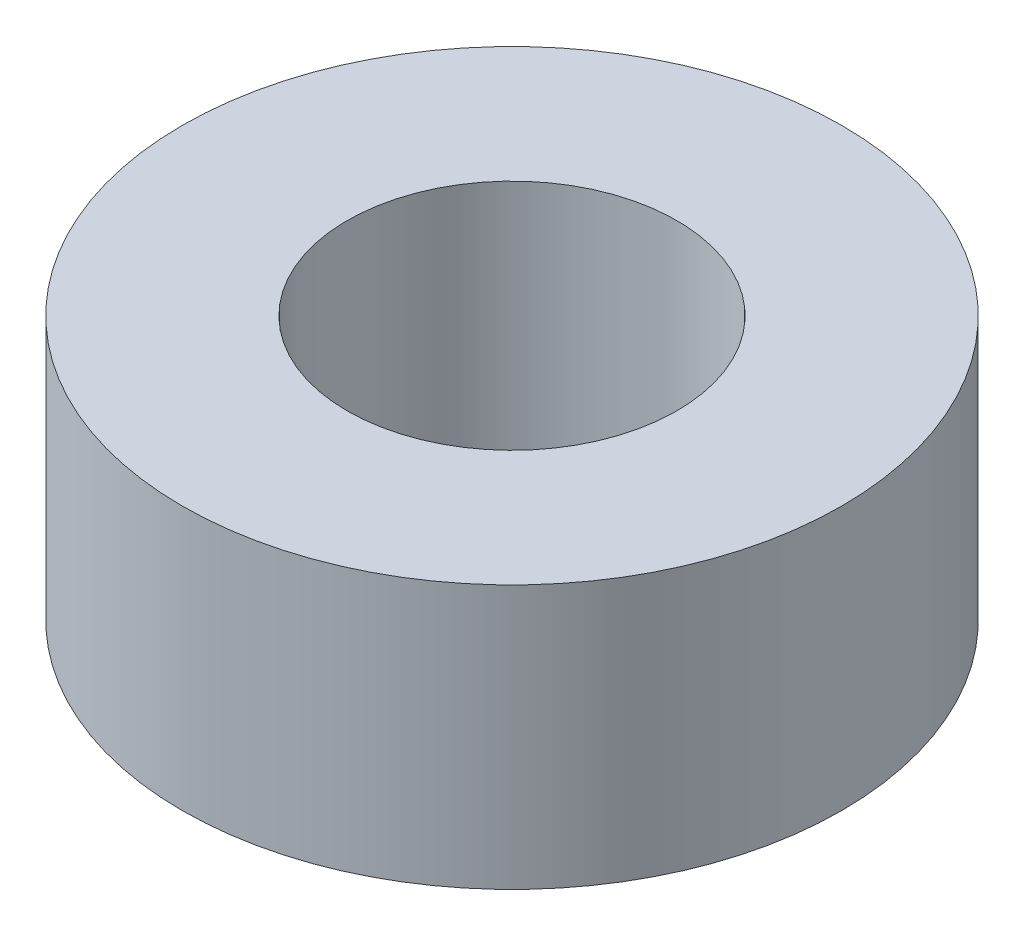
from build123d import *

# Parameters (mm, degrees)
SKETCH_1_R      = 5
SKETCH_1_R_2    = 2.5
EXTRUDE_1_DEPTH = 2


with BuildPart() as part:
    # Sketch 1 → Extrude 1 (new, symmetric)
    with BuildSketch(Plane(origin=(0, 0, 0), x_dir=(1, 0, 0), z_dir=(0, 1, 0))):
        with Locations(Location((0, 0, 0), (0, 0, 270))):
            Circle(SKETCH_1_R)
        with Locations(Location((0, 0, 0), (0, 0, 270))):
            Circle(SKETCH_1_R_2, mode=Mode.SUBTRACT)
    extrude(amount=EXTRUDE_1_DEPTH, both=True)


solid = part.part
